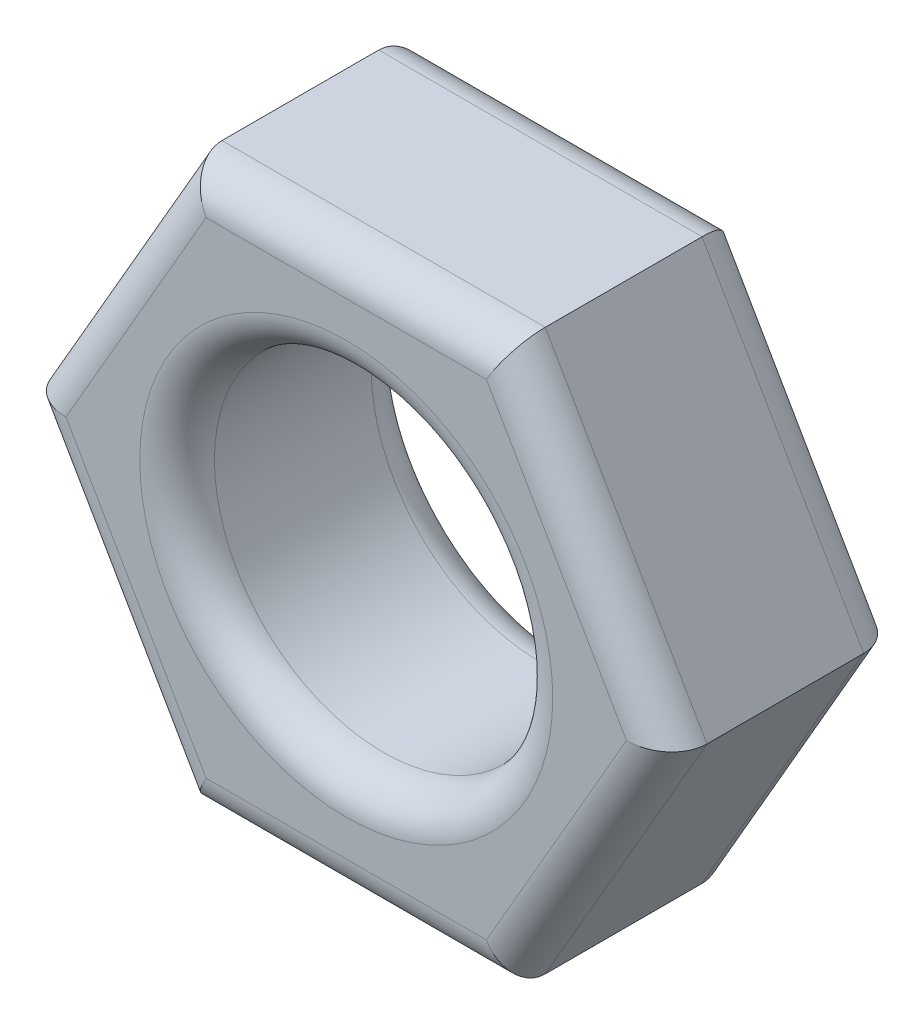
ISO-10303-21;
HEADER;
FILE_DESCRIPTION(('STEP AP214'),'2;1');
FILE_NAME('part.step','',(''),(''),'','','');
FILE_SCHEMA(('AUTOMOTIVE_DESIGN { 1 0 10303 214 1 1 1 1 }'));
ENDSEC;
DATA;
#1=APPLICATION_CONTEXT('core data for automotive mechanical design processes');
#2=APPLICATION_PROTOCOL_DEFINITION('international standard','automotive_design',2000,#1);
#3=PRODUCT_CONTEXT('',#1,'mechanical');
#4=PRODUCT('Part','Part','',(#3));
#5=PRODUCT_RELATED_PRODUCT_CATEGORY('part','',(#4));
#6=PRODUCT_DEFINITION_FORMATION('','',#4);
#7=PRODUCT_DEFINITION_CONTEXT('part definition',#1,'design');
#8=PRODUCT_DEFINITION('design','',#6,#7);
#9=PRODUCT_DEFINITION_SHAPE('','',#8);
#10=(LENGTH_UNIT() NAMED_UNIT(*) SI_UNIT(.MILLI.,.METRE.));
#11=(NAMED_UNIT(*) PLANE_ANGLE_UNIT() SI_UNIT($,.RADIAN.));
#12=(NAMED_UNIT(*) SI_UNIT($,.STERADIAN.) SOLID_ANGLE_UNIT());
#13=UNCERTAINTY_MEASURE_WITH_UNIT(LENGTH_MEASURE(1.E-05),#10,'distance_accuracy_value','');
#14=(GEOMETRIC_REPRESENTATION_CONTEXT(3) GLOBAL_UNCERTAINTY_ASSIGNED_CONTEXT((#13)) GLOBAL_UNIT_ASSIGNED_CONTEXT((#10,
#11,#12)) REPRESENTATION_CONTEXT('',''));
#15=CARTESIAN_POINT('',(0.,0.,0.));
#16=DIRECTION('',(0.,0.,1.));
#17=DIRECTION('',(1.,0.,0.));
#18=AXIS2_PLACEMENT_3D('',#15,#16,#17);
#19=CARTESIAN_POINT('',(16.4977839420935,9.52499999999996,7.874));
#20=DIRECTION('',(0.,0.,-1.));
#21=DIRECTION('',(-1.,0.,0.));
#22=AXIS2_PLACEMENT_3D('',#19,#20,#21);
#23=PLANE('',#22);
#24=CARTESIAN_POINT('',(0.,0.,7.874));
#25=DIRECTION('',(0.,0.,-1.));
#26=DIRECTION('',(-1.,0.,0.));
#27=AXIS2_PLACEMENT_3D('',#24,#25,#26);
#28=CIRCLE('',#27,7.0231);
#29=CARTESIAN_POINT('',(-7.0231,0.,7.874));
#30=VERTEX_POINT('',#29);
#31=EDGE_CURVE('E187',#30,#30,#28,.T.);
#32=ORIENTED_EDGE('',*,*,#31,.T.);
#33=EDGE_LOOP('',(#32));
#34=FACE_BOUND('',#33,.T.);
#35=DIRECTION('',(0.499999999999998,-0.86602540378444,0.));
#36=VECTOR('',#35,1.);
#37=CARTESIAN_POINT('',(-7.14903970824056,-4.12749999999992,7.874));
#38=LINE('',#37,#36);
#39=CARTESIAN_POINT('',(-9.53205294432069,0.,7.874));
#40=VERTEX_POINT('',#39);
#41=CARTESIAN_POINT('',(-4.76602647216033,-8.25500000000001,7.874));
#42=VERTEX_POINT('',#41);
#43=EDGE_CURVE('E182',#40,#42,#38,.T.);
#44=ORIENTED_EDGE('',*,*,#43,.T.);
#45=DIRECTION('',(1.,0.,0.));
#46=VECTOR('',#45,1.);
#47=CARTESIAN_POINT('',(16.4977839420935,-8.25500000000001,7.874));
#48=LINE('',#47,#46);
#49=CARTESIAN_POINT('',(4.76602647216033,-8.25500000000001,7.874));
#50=VERTEX_POINT('',#49);
#51=EDGE_CURVE('E184',#42,#50,#48,.T.);
#52=ORIENTED_EDGE('',*,*,#51,.T.);
#53=DIRECTION('',(0.499999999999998,0.86602540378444,0.));
#54=VECTOR('',#53,1.);
#55=CARTESIAN_POINT('',(15.3979316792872,10.16,7.874));
#56=LINE('',#55,#54);
#57=CARTESIAN_POINT('',(9.53205294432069,0.,7.874));
#58=VERTEX_POINT('',#57);
#59=EDGE_CURVE('E174',#50,#58,#56,.T.);
#60=ORIENTED_EDGE('',*,*,#59,.T.);
#61=DIRECTION('',(-0.499999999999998,0.86602540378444,0.));
#62=VECTOR('',#61,1.);
#63=CARTESIAN_POINT('',(7.14903970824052,4.12750000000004,7.874));
#64=LINE('',#63,#62);
#65=CARTESIAN_POINT('',(4.76602647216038,8.25499999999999,7.874));
#66=VERTEX_POINT('',#65);
#67=EDGE_CURVE('E176',#58,#66,#64,.T.);
#68=ORIENTED_EDGE('',*,*,#67,.T.);
#69=DIRECTION('',(-1.,0.,0.));
#70=VECTOR('',#69,1.);
#71=CARTESIAN_POINT('',(16.4977839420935,8.25499999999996,7.874));
#72=LINE('',#71,#70);
#73=CARTESIAN_POINT('',(-4.76602647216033,8.25500000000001,7.874));
#74=VERTEX_POINT('',#73);
#75=EDGE_CURVE('E178',#66,#74,#72,.T.);
#76=ORIENTED_EDGE('',*,*,#75,.T.);
#77=DIRECTION('',(-0.5,-0.866025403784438,0.));
#78=VECTOR('',#77,1.);
#79=CARTESIAN_POINT('',(1.09985226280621,18.4149999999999,7.874));
#80=LINE('',#79,#78);
#81=EDGE_CURVE('E180',#74,#40,#80,.T.);
#82=ORIENTED_EDGE('',*,*,#81,.T.);
#83=EDGE_LOOP('',(#44,#52,#60,#68,#76,#82));
#84=FACE_BOUND('',#83,.T.);
#85=ADVANCED_FACE('F28',(#34,#84),#23,.F.);
#86=CARTESIAN_POINT('',(16.4977839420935,9.52499999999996,0.));
#87=DIRECTION('',(0.,0.,-1.));
#88=DIRECTION('',(-1.,0.,0.));
#89=AXIS2_PLACEMENT_3D('',#86,#87,#88);
#90=PLANE('',#89);
#91=CARTESIAN_POINT('',(0.,0.,0.));
#92=DIRECTION('',(0.,0.,-1.));
#93=DIRECTION('',(-1.,0.,0.));
#94=AXIS2_PLACEMENT_3D('',#91,#92,#93);
#95=CIRCLE('',#94,7.0231);
#96=CARTESIAN_POINT('',(-7.0231,0.,0.));
#97=VERTEX_POINT('',#96);
#98=EDGE_CURVE('E144',#97,#97,#95,.F.);
#99=ORIENTED_EDGE('',*,*,#98,.T.);
#100=EDGE_LOOP('',(#99));
#101=FACE_BOUND('',#100,.T.);
#102=DIRECTION('',(-1.,0.,0.));
#103=VECTOR('',#102,1.);
#104=CARTESIAN_POINT('',(5.4992613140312,8.25499999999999,0.));
#105=LINE('',#104,#103);
#106=CARTESIAN_POINT('',(-4.76602647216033,8.25500000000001,0.));
#107=VERTEX_POINT('',#106);
#108=CARTESIAN_POINT('',(4.76602647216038,8.25499999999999,0.));
#109=VERTEX_POINT('',#108);
#110=EDGE_CURVE('E143',#107,#109,#105,.F.);
#111=ORIENTED_EDGE('',*,*,#110,.T.);
#112=DIRECTION('',(-0.499999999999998,0.86602540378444,0.));
#113=VECTOR('',#112,1.);
#114=CARTESIAN_POINT('',(9.8986703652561,-0.634999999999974,0.));
#115=LINE('',#114,#113);
#116=CARTESIAN_POINT('',(9.53205294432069,0.,0.));
#117=VERTEX_POINT('',#116);
#118=EDGE_CURVE('E122',#109,#117,#115,.F.);
#119=ORIENTED_EDGE('',*,*,#118,.T.);
#120=DIRECTION('',(0.499999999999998,0.86602540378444,0.));
#121=VECTOR('',#120,1.);
#122=CARTESIAN_POINT('',(9.8986703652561,0.635000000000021,0.));
#123=LINE('',#122,#121);
#124=CARTESIAN_POINT('',(4.76602647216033,-8.25500000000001,0.));
#125=VERTEX_POINT('',#124);
#126=EDGE_CURVE('E132',#117,#125,#123,.F.);
#127=ORIENTED_EDGE('',*,*,#126,.T.);
#128=DIRECTION('',(1.,0.,0.));
#129=VECTOR('',#128,1.);
#130=CARTESIAN_POINT('',(5.49926131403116,-8.25500000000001,0.));
#131=LINE('',#130,#129);
#132=CARTESIAN_POINT('',(-4.76602647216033,-8.25500000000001,0.));
#133=VERTEX_POINT('',#132);
#134=EDGE_CURVE('E138',#125,#133,#131,.F.);
#135=ORIENTED_EDGE('',*,*,#134,.T.);
#136=DIRECTION('',(0.499999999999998,-0.86602540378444,0.));
#137=VECTOR('',#136,1.);
#138=CARTESIAN_POINT('',(-9.8986703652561,0.635000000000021,0.));
#139=LINE('',#138,#137);
#140=CARTESIAN_POINT('',(-9.53205294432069,0.,0.));
#141=VERTEX_POINT('',#140);
#142=EDGE_CURVE('E245',#133,#141,#139,.F.);
#143=ORIENTED_EDGE('',*,*,#142,.T.);
#144=DIRECTION('',(-0.5,-0.866025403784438,0.));
#145=VECTOR('',#144,1.);
#146=CARTESIAN_POINT('',(-9.8986703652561,-0.634999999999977,0.));
#147=LINE('',#146,#145);
#148=EDGE_CURVE('E149',#141,#107,#147,.F.);
#149=ORIENTED_EDGE('',*,*,#148,.T.);
#150=EDGE_LOOP('',(#111,#119,#127,#135,#143,#149));
#151=FACE_BOUND('',#150,.T.);
#152=ADVANCED_FACE('F141',(#101,#151),#90,.T.);
#153=CARTESIAN_POINT('',(10.9985226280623,0.,7.874));
#154=DIRECTION('',(-0.86602540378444,0.499999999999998,0.));
#155=DIRECTION('',(-0.499999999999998,-0.86602540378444,0.));
#156=AXIS2_PLACEMENT_3D('',#153,#154,#155);
#157=PLANE('',#156);
#158=DIRECTION('',(0.,0.,-1.));
#159=VECTOR('',#158,1.);
#160=CARTESIAN_POINT('',(10.9985226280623,0.,7.874));
#161=LINE('',#160,#159);
#162=CARTESIAN_POINT('',(10.9985226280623,0.,6.604));
#163=VERTEX_POINT('',#162);
#164=CARTESIAN_POINT('',(10.9985226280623,0.,1.27));
#165=VERTEX_POINT('',#164);
#166=EDGE_CURVE('E139',#163,#165,#161,.T.);
#167=ORIENTED_EDGE('',*,*,#166,.F.);
#168=DIRECTION('',(0.499999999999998,0.86602540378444,0.));
#169=VECTOR('',#168,1.);
#170=CARTESIAN_POINT('',(10.9985226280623,0.,6.604));
#171=LINE('',#170,#169);
#172=CARTESIAN_POINT('',(5.49926131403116,-9.52500000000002,6.604));
#173=VERTEX_POINT('',#172);
#174=EDGE_CURVE('E11',#163,#173,#171,.F.);
#175=ORIENTED_EDGE('',*,*,#174,.T.);
#176=DIRECTION('',(0.,0.,-1.));
#177=VECTOR('',#176,1.);
#178=CARTESIAN_POINT('',(5.49926131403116,-9.52500000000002,7.874));
#179=LINE('',#178,#177);
#180=CARTESIAN_POINT('',(5.49926131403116,-9.52500000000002,1.27));
#181=VERTEX_POINT('',#180);
#182=EDGE_CURVE('E237',#173,#181,#179,.T.);
#183=ORIENTED_EDGE('',*,*,#182,.T.);
#184=DIRECTION('',(0.499999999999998,0.86602540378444,0.));
#185=VECTOR('',#184,1.);
#186=CARTESIAN_POINT('',(10.9985226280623,0.,1.27));
#187=LINE('',#186,#185);
#188=EDGE_CURVE('E168',#181,#165,#187,.T.);
#189=ORIENTED_EDGE('',*,*,#188,.T.);
#190=EDGE_LOOP('',(#167,#175,#183,#189));
#191=FACE_BOUND('',#190,.T.);
#192=ADVANCED_FACE('F30',(#191),#157,.F.);
#193=CARTESIAN_POINT('',(10.9985226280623,0.,7.874));
#194=DIRECTION('',(-0.86602540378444,-0.499999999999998,0.));
#195=DIRECTION('',(0.499999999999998,-0.86602540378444,0.));
#196=AXIS2_PLACEMENT_3D('',#193,#194,#195);
#197=PLANE('',#196);
#198=DIRECTION('',(0.,0.,-1.));
#199=VECTOR('',#198,1.);
#200=CARTESIAN_POINT('',(5.4992613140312,9.52499999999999,7.874));
#201=LINE('',#200,#199);
#202=CARTESIAN_POINT('',(5.4992613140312,9.52499999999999,6.604));
#203=VERTEX_POINT('',#202);
#204=CARTESIAN_POINT('',(5.4992613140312,9.52499999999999,1.27));
#205=VERTEX_POINT('',#204);
#206=EDGE_CURVE('E210',#203,#205,#201,.T.);
#207=ORIENTED_EDGE('',*,*,#206,.F.);
#208=DIRECTION('',(-0.499999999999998,0.86602540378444,0.));
#209=VECTOR('',#208,1.);
#210=CARTESIAN_POINT('',(10.9985226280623,0.,6.604));
#211=LINE('',#210,#209);
#212=EDGE_CURVE('E36',#203,#163,#211,.F.);
#213=ORIENTED_EDGE('',*,*,#212,.T.);
#214=ORIENTED_EDGE('',*,*,#166,.T.);
#215=DIRECTION('',(-0.499999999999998,0.86602540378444,0.));
#216=VECTOR('',#215,1.);
#217=CARTESIAN_POINT('',(10.9985226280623,0.,1.27));
#218=LINE('',#217,#216);
#219=EDGE_CURVE('E125',#165,#205,#218,.T.);
#220=ORIENTED_EDGE('',*,*,#219,.T.);
#221=EDGE_LOOP('',(#207,#213,#214,#220));
#222=FACE_BOUND('',#221,.T.);
#223=ADVANCED_FACE('F254',(#222),#197,.F.);
#224=CARTESIAN_POINT('',(5.4992613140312,9.52499999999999,7.874));
#225=DIRECTION('',(0.,-1.,0.));
#226=DIRECTION('',(1.,0.,0.));
#227=AXIS2_PLACEMENT_3D('',#224,#225,#226);
#228=PLANE('',#227);
#229=DIRECTION('',(0.,0.,-1.));
#230=VECTOR('',#229,1.);
#231=CARTESIAN_POINT('',(-5.49926131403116,9.52500000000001,7.874));
#232=LINE('',#231,#230);
#233=CARTESIAN_POINT('',(-5.49926131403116,9.52500000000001,6.604));
#234=VERTEX_POINT('',#233);
#235=CARTESIAN_POINT('',(-5.49926131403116,9.52500000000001,1.27));
#236=VERTEX_POINT('',#235);
#237=EDGE_CURVE('E201',#234,#236,#232,.T.);
#238=ORIENTED_EDGE('',*,*,#237,.F.);
#239=DIRECTION('',(-1.,0.,0.));
#240=VECTOR('',#239,1.);
#241=CARTESIAN_POINT('',(5.4992613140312,9.52499999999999,6.604));
#242=LINE('',#241,#240);
#243=EDGE_CURVE('E50',#234,#203,#242,.F.);
#244=ORIENTED_EDGE('',*,*,#243,.T.);
#245=ORIENTED_EDGE('',*,*,#206,.T.);
#246=DIRECTION('',(-1.,0.,0.));
#247=VECTOR('',#246,1.);
#248=CARTESIAN_POINT('',(5.4992613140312,9.52499999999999,1.27));
#249=LINE('',#248,#247);
#250=EDGE_CURVE('E156',#205,#236,#249,.T.);
#251=ORIENTED_EDGE('',*,*,#250,.T.);
#252=EDGE_LOOP('',(#238,#244,#245,#251));
#253=FACE_BOUND('',#252,.T.);
#254=ADVANCED_FACE('F207',(#253),#228,.F.);
#255=CARTESIAN_POINT('',(-10.9985226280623,0.,7.874));
#256=DIRECTION('',(0.866025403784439,-0.5,0.));
#257=DIRECTION('',(0.5,0.866025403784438,0.));
#258=AXIS2_PLACEMENT_3D('',#255,#256,#257);
#259=PLANE('',#258);
#260=DIRECTION('',(0.,0.,-1.));
#261=VECTOR('',#260,1.);
#262=CARTESIAN_POINT('',(-10.9985226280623,0.,7.874));
#263=LINE('',#262,#261);
#264=CARTESIAN_POINT('',(-10.9985226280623,0.,6.604));
#265=VERTEX_POINT('',#264);
#266=CARTESIAN_POINT('',(-10.9985226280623,0.,1.27));
#267=VERTEX_POINT('',#266);
#268=EDGE_CURVE('E202',#265,#267,#263,.T.);
#269=ORIENTED_EDGE('',*,*,#268,.F.);
#270=DIRECTION('',(-0.5,-0.866025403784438,0.));
#271=VECTOR('',#270,1.);
#272=CARTESIAN_POINT('',(-10.9985226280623,0.,6.604));
#273=LINE('',#272,#271);
#274=EDGE_CURVE('E195',#265,#234,#273,.F.);
#275=ORIENTED_EDGE('',*,*,#274,.T.);
#276=ORIENTED_EDGE('',*,*,#237,.T.);
#277=DIRECTION('',(-0.5,-0.866025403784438,0.));
#278=VECTOR('',#277,1.);
#279=CARTESIAN_POINT('',(-10.9985226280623,0.,1.27));
#280=LINE('',#279,#278);
#281=EDGE_CURVE('E159',#236,#267,#280,.T.);
#282=ORIENTED_EDGE('',*,*,#281,.T.);
#283=EDGE_LOOP('',(#269,#275,#276,#282));
#284=FACE_BOUND('',#283,.T.);
#285=ADVANCED_FACE('F200',(#284),#259,.F.);
#286=CARTESIAN_POINT('',(-10.9985226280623,0.,7.874));
#287=DIRECTION('',(0.86602540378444,0.499999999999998,0.));
#288=DIRECTION('',(-0.499999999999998,0.86602540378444,0.));
#289=AXIS2_PLACEMENT_3D('',#286,#287,#288);
#290=PLANE('',#289);
#291=DIRECTION('',(0.,0.,-1.));
#292=VECTOR('',#291,1.);
#293=CARTESIAN_POINT('',(-5.49926131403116,-9.52500000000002,7.874));
#294=LINE('',#293,#292);
#295=CARTESIAN_POINT('',(-5.49926131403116,-9.52500000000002,6.604));
#296=VERTEX_POINT('',#295);
#297=CARTESIAN_POINT('',(-5.49926131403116,-9.52500000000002,1.27));
#298=VERTEX_POINT('',#297);
#299=EDGE_CURVE('E239',#296,#298,#294,.T.);
#300=ORIENTED_EDGE('',*,*,#299,.F.);
#301=DIRECTION('',(0.499999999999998,-0.86602540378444,0.));
#302=VECTOR('',#301,1.);
#303=CARTESIAN_POINT('',(-10.9985226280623,0.,6.604));
#304=LINE('',#303,#302);
#305=EDGE_CURVE('E193',#296,#265,#304,.F.);
#306=ORIENTED_EDGE('',*,*,#305,.T.);
#307=ORIENTED_EDGE('',*,*,#268,.T.);
#308=DIRECTION('',(0.499999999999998,-0.86602540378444,0.));
#309=VECTOR('',#308,1.);
#310=CARTESIAN_POINT('',(-10.9985226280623,0.,1.27));
#311=LINE('',#310,#309);
#312=EDGE_CURVE('E162',#267,#298,#311,.T.);
#313=ORIENTED_EDGE('',*,*,#312,.T.);
#314=EDGE_LOOP('',(#300,#306,#307,#313));
#315=FACE_BOUND('',#314,.T.);
#316=ADVANCED_FACE('F271',(#315),#290,.F.);
#317=CARTESIAN_POINT('',(5.49926131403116,-9.52500000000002,7.874));
#318=DIRECTION('',(0.,1.,0.));
#319=DIRECTION('',(0.,0.,1.));
#320=AXIS2_PLACEMENT_3D('',#317,#318,#319);
#321=PLANE('',#320);
#322=ORIENTED_EDGE('',*,*,#182,.F.);
#323=DIRECTION('',(1.,0.,0.));
#324=VECTOR('',#323,1.);
#325=CARTESIAN_POINT('',(5.49926131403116,-9.52500000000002,6.604));
#326=LINE('',#325,#324);
#327=EDGE_CURVE('E190',#173,#296,#326,.F.);
#328=ORIENTED_EDGE('',*,*,#327,.T.);
#329=ORIENTED_EDGE('',*,*,#299,.T.);
#330=DIRECTION('',(1.,0.,0.));
#331=VECTOR('',#330,1.);
#332=CARTESIAN_POINT('',(5.49926131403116,-9.52500000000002,1.27));
#333=LINE('',#332,#331);
#334=EDGE_CURVE('E165',#298,#181,#333,.T.);
#335=ORIENTED_EDGE('',*,*,#334,.T.);
#336=EDGE_LOOP('',(#322,#328,#329,#335));
#337=FACE_BOUND('',#336,.T.);
#338=ADVANCED_FACE('F262',(#337),#321,.F.);
#339=CARTESIAN_POINT('',(0.,0.,7.874));
#340=DIRECTION('',(0.,0.,-1.));
#341=DIRECTION('',(-1.,0.,0.));
#342=AXIS2_PLACEMENT_3D('',#339,#340,#341);
#343=CYLINDRICAL_SURFACE('',#342,5.7531);
#344=CARTESIAN_POINT('',(0.,0.,6.604));
#345=DIRECTION('',(0.,0.,-1.));
#346=DIRECTION('',(-1.,0.,0.));
#347=AXIS2_PLACEMENT_3D('',#344,#345,#346);
#348=CIRCLE('',#347,5.7531);
#349=CARTESIAN_POINT('',(-5.7531,0.,6.604));
#350=VERTEX_POINT('',#349);
#351=EDGE_CURVE('E171',#350,#350,#348,.F.);
#352=ORIENTED_EDGE('',*,*,#351,.T.);
#353=EDGE_LOOP('',(#352));
#354=FACE_BOUND('',#353,.T.);
#355=CARTESIAN_POINT('',(0.,0.,1.27));
#356=DIRECTION('',(0.,0.,-1.));
#357=DIRECTION('',(-1.,0.,0.));
#358=AXIS2_PLACEMENT_3D('',#355,#356,#357);
#359=CIRCLE('',#358,5.7531);
#360=CARTESIAN_POINT('',(-5.7531,0.,1.27));
#361=VERTEX_POINT('',#360);
#362=EDGE_CURVE('E147',#361,#361,#359,.T.);
#363=ORIENTED_EDGE('',*,*,#362,.T.);
#364=EDGE_LOOP('',(#363));
#365=FACE_BOUND('',#364,.T.);
#366=ADVANCED_FACE('F307',(#354,#365),#343,.F.);
#367=CARTESIAN_POINT('',(0.,0.,1.27));
#368=DIRECTION('',(0.,0.,-1.));
#369=DIRECTION('',(-1.,0.,0.));
#370=AXIS2_PLACEMENT_3D('',#367,#368,#369);
#371=TOROIDAL_SURFACE('',#370,7.0231,1.27);
#372=ORIENTED_EDGE('',*,*,#362,.F.);
#373=EDGE_LOOP('',(#372));
#374=FACE_BOUND('',#373,.T.);
#375=ORIENTED_EDGE('',*,*,#98,.F.);
#376=EDGE_LOOP('',(#375));
#377=FACE_BOUND('',#376,.T.);
#378=ADVANCED_FACE('F363',(#374,#377),#371,.T.);
#379=CARTESIAN_POINT('',(-9.8986703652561,0.635000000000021,1.27));
#380=DIRECTION('',(-0.499999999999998,0.86602540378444,0.));
#381=DIRECTION('',(-0.86602540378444,-0.499999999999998,0.));
#382=AXIS2_PLACEMENT_3D('',#379,#380,#381);
#383=CYLINDRICAL_SURFACE('',#382,1.27);
#384=CARTESIAN_POINT('',(-9.53205294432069,0.,1.27));
#385=DIRECTION('',(0.,1.,0.));
#386=DIRECTION('',(-1.,0.,0.));
#387=AXIS2_PLACEMENT_3D('',#384,#385,#386);
#388=ELLIPSE('',#387,1.46646968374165,1.27);
#389=EDGE_CURVE('E231',#141,#267,#388,.T.);
#390=ORIENTED_EDGE('',*,*,#389,.F.);
#391=ORIENTED_EDGE('',*,*,#142,.F.);
#392=CARTESIAN_POINT('',(-4.76602647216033,-8.25500000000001,1.27));
#393=DIRECTION('',(-0.866025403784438,0.500000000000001,0.));
#394=DIRECTION('',(-0.500000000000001,-0.866025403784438,0.));
#395=AXIS2_PLACEMENT_3D('',#392,#393,#394);
#396=ELLIPSE('',#395,1.46646968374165,1.27);
#397=EDGE_CURVE('E234',#298,#133,#396,.F.);
#398=ORIENTED_EDGE('',*,*,#397,.F.);
#399=ORIENTED_EDGE('',*,*,#312,.F.);
#400=EDGE_LOOP('',(#390,#391,#398,#399));
#401=FACE_BOUND('',#400,.T.);
#402=ADVANCED_FACE('F268',(#401),#383,.T.);
#403=CARTESIAN_POINT('',(5.49926131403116,-8.25500000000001,1.27));
#404=DIRECTION('',(-1.,0.,0.));
#405=DIRECTION('',(0.,0.,1.));
#406=AXIS2_PLACEMENT_3D('',#403,#404,#405);
#407=CYLINDRICAL_SURFACE('',#406,1.27);
#408=ORIENTED_EDGE('',*,*,#397,.T.);
#409=ORIENTED_EDGE('',*,*,#134,.F.);
#410=CARTESIAN_POINT('',(4.76602647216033,-8.25500000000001,1.27));
#411=DIRECTION('',(-0.866025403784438,-0.500000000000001,0.));
#412=DIRECTION('',(0.500000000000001,-0.866025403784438,0.));
#413=AXIS2_PLACEMENT_3D('',#410,#411,#412);
#414=ELLIPSE('',#413,1.46646968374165,1.27);
#415=EDGE_CURVE('E135',#181,#125,#414,.F.);
#416=ORIENTED_EDGE('',*,*,#415,.F.);
#417=ORIENTED_EDGE('',*,*,#334,.F.);
#418=EDGE_LOOP('',(#408,#409,#416,#417));
#419=FACE_BOUND('',#418,.T.);
#420=ADVANCED_FACE('F265',(#419),#407,.T.);
#421=CARTESIAN_POINT('',(-9.8986703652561,-0.634999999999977,1.27));
#422=DIRECTION('',(0.5,0.866025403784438,0.));
#423=DIRECTION('',(-0.866025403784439,0.5,0.));
#424=AXIS2_PLACEMENT_3D('',#421,#422,#423);
#425=CYLINDRICAL_SURFACE('',#424,1.27);
#426=ORIENTED_EDGE('',*,*,#389,.T.);
#427=ORIENTED_EDGE('',*,*,#281,.F.);
#428=CARTESIAN_POINT('',(-4.76602647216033,8.25500000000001,1.27));
#429=DIRECTION('',(0.866025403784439,0.499999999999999,0.));
#430=DIRECTION('',(-0.499999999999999,0.866025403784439,0.));
#431=AXIS2_PLACEMENT_3D('',#428,#429,#430);
#432=ELLIPSE('',#431,1.46646968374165,1.27);
#433=EDGE_CURVE('E128',#107,#236,#432,.T.);
#434=ORIENTED_EDGE('',*,*,#433,.F.);
#435=ORIENTED_EDGE('',*,*,#148,.F.);
#436=EDGE_LOOP('',(#426,#427,#434,#435));
#437=FACE_BOUND('',#436,.T.);
#438=ADVANCED_FACE('F251',(#437),#425,.T.);
#439=CARTESIAN_POINT('',(9.8986703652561,0.635000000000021,1.27));
#440=DIRECTION('',(-0.499999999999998,-0.86602540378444,0.));
#441=DIRECTION('',(0.86602540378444,-0.499999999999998,0.));
#442=AXIS2_PLACEMENT_3D('',#439,#440,#441);
#443=CYLINDRICAL_SURFACE('',#442,1.27);
#444=ORIENTED_EDGE('',*,*,#415,.T.);
#445=ORIENTED_EDGE('',*,*,#126,.F.);
#446=CARTESIAN_POINT('',(9.53205294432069,0.,1.27));
#447=DIRECTION('',(0.,-1.,0.));
#448=DIRECTION('',(-1.,0.,0.));
#449=AXIS2_PLACEMENT_3D('',#446,#447,#448);
#450=ELLIPSE('',#449,1.46646968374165,1.27);
#451=EDGE_CURVE('E117',#165,#117,#450,.F.);
#452=ORIENTED_EDGE('',*,*,#451,.F.);
#453=ORIENTED_EDGE('',*,*,#188,.F.);
#454=EDGE_LOOP('',(#444,#445,#452,#453));
#455=FACE_BOUND('',#454,.T.);
#456=ADVANCED_FACE('F133',(#455),#443,.T.);
#457=CARTESIAN_POINT('',(5.4992613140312,8.25499999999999,1.27));
#458=DIRECTION('',(1.,0.,0.));
#459=DIRECTION('',(0.,1.,0.));
#460=AXIS2_PLACEMENT_3D('',#457,#458,#459);
#461=CYLINDRICAL_SURFACE('',#460,1.27);
#462=ORIENTED_EDGE('',*,*,#433,.T.);
#463=ORIENTED_EDGE('',*,*,#250,.F.);
#464=CARTESIAN_POINT('',(4.76602647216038,8.25499999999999,1.27));
#465=DIRECTION('',(0.866025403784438,-0.500000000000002,0.));
#466=DIRECTION('',(0.500000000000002,0.866025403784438,0.));
#467=AXIS2_PLACEMENT_3D('',#464,#465,#466);
#468=ELLIPSE('',#467,1.46646968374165,1.27);
#469=EDGE_CURVE('E129',#109,#205,#468,.T.);
#470=ORIENTED_EDGE('',*,*,#469,.F.);
#471=ORIENTED_EDGE('',*,*,#110,.F.);
#472=EDGE_LOOP('',(#462,#463,#470,#471));
#473=FACE_BOUND('',#472,.T.);
#474=ADVANCED_FACE('F253',(#473),#461,.T.);
#475=CARTESIAN_POINT('',(9.8986703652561,-0.634999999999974,1.27));
#476=DIRECTION('',(0.499999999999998,-0.86602540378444,0.));
#477=DIRECTION('',(0.86602540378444,0.499999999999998,0.));
#478=AXIS2_PLACEMENT_3D('',#475,#476,#477);
#479=CYLINDRICAL_SURFACE('',#478,1.27);
#480=ORIENTED_EDGE('',*,*,#451,.T.);
#481=ORIENTED_EDGE('',*,*,#118,.F.);
#482=ORIENTED_EDGE('',*,*,#469,.T.);
#483=ORIENTED_EDGE('',*,*,#219,.F.);
#484=EDGE_LOOP('',(#480,#481,#482,#483));
#485=FACE_BOUND('',#484,.T.);
#486=ADVANCED_FACE('F119',(#485),#479,.T.);
#487=CARTESIAN_POINT('',(0.,0.,6.604));
#488=DIRECTION('',(0.,0.,-1.));
#489=DIRECTION('',(-1.,0.,0.));
#490=AXIS2_PLACEMENT_3D('',#487,#488,#489);
#491=TOROIDAL_SURFACE('',#490,7.0231,1.27);
#492=ORIENTED_EDGE('',*,*,#31,.F.);
#493=EDGE_LOOP('',(#492));
#494=FACE_BOUND('',#493,.T.);
#495=ORIENTED_EDGE('',*,*,#351,.F.);
#496=EDGE_LOOP('',(#495));
#497=FACE_BOUND('',#496,.T.);
#498=ADVANCED_FACE('F414',(#494,#497),#491,.T.);
#499=CARTESIAN_POINT('',(16.4977839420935,8.25499999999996,6.604));
#500=DIRECTION('',(-1.,0.,0.));
#501=DIRECTION('',(0.,-1.,0.));
#502=AXIS2_PLACEMENT_3D('',#499,#500,#501);
#503=CYLINDRICAL_SURFACE('',#502,1.27);
#504=CARTESIAN_POINT('',(4.76602647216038,8.25499999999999,6.604));
#505=DIRECTION('',(-0.866025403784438,0.500000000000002,0.));
#506=DIRECTION('',(0.500000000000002,0.866025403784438,0.));
#507=AXIS2_PLACEMENT_3D('',#504,#505,#506);
#508=ELLIPSE('',#507,1.46646968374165,1.27);
#509=EDGE_CURVE('E220',#203,#66,#508,.F.);
#510=ORIENTED_EDGE('',*,*,#509,.F.);
#511=ORIENTED_EDGE('',*,*,#243,.F.);
#512=CARTESIAN_POINT('',(-4.76602647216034,8.25500000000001,6.604));
#513=DIRECTION('',(-0.866025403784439,-0.499999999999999,0.));
#514=DIRECTION('',(-0.499999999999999,0.866025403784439,0.));
#515=AXIS2_PLACEMENT_3D('',#512,#513,#514);
#516=ELLIPSE('',#515,1.46646968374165,1.27);
#517=EDGE_CURVE('E217',#74,#234,#516,.T.);
#518=ORIENTED_EDGE('',*,*,#517,.F.);
#519=ORIENTED_EDGE('',*,*,#75,.F.);
#520=EDGE_LOOP('',(#510,#511,#518,#519));
#521=FACE_BOUND('',#520,.T.);
#522=ADVANCED_FACE('F215',(#521),#503,.T.);
#523=CARTESIAN_POINT('',(1.09985226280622,18.4149999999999,6.604));
#524=DIRECTION('',(-0.5,-0.866025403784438,0.));
#525=DIRECTION('',(0.866025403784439,-0.5,0.));
#526=AXIS2_PLACEMENT_3D('',#523,#524,#525);
#527=CYLINDRICAL_SURFACE('',#526,1.27);
#528=ORIENTED_EDGE('',*,*,#517,.T.);
#529=ORIENTED_EDGE('',*,*,#274,.F.);
#530=CARTESIAN_POINT('',(-9.53205294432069,0.,6.604));
#531=DIRECTION('',(0.,-1.,0.));
#532=DIRECTION('',(-1.,0.,0.));
#533=AXIS2_PLACEMENT_3D('',#530,#531,#532);
#534=ELLIPSE('',#533,1.46646968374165,1.27);
#535=EDGE_CURVE('E224',#40,#265,#534,.T.);
#536=ORIENTED_EDGE('',*,*,#535,.F.);
#537=ORIENTED_EDGE('',*,*,#81,.F.);
#538=EDGE_LOOP('',(#528,#529,#536,#537));
#539=FACE_BOUND('',#538,.T.);
#540=ADVANCED_FACE('F221',(#539),#527,.T.);
#541=CARTESIAN_POINT('',(7.14903970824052,4.12750000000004,6.604));
#542=DIRECTION('',(-0.499999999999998,0.86602540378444,0.));
#543=DIRECTION('',(-0.86602540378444,-0.499999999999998,0.));
#544=AXIS2_PLACEMENT_3D('',#541,#542,#543);
#545=CYLINDRICAL_SURFACE('',#544,1.27);
#546=ORIENTED_EDGE('',*,*,#509,.T.);
#547=ORIENTED_EDGE('',*,*,#67,.F.);
#548=CARTESIAN_POINT('',(9.53205294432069,0.,6.604));
#549=DIRECTION('',(0.,1.,0.));
#550=DIRECTION('',(1.,0.,0.));
#551=AXIS2_PLACEMENT_3D('',#548,#549,#550);
#552=ELLIPSE('',#551,1.46646968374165,1.27);
#553=EDGE_CURVE('E288',#163,#58,#552,.F.);
#554=ORIENTED_EDGE('',*,*,#553,.F.);
#555=ORIENTED_EDGE('',*,*,#212,.F.);
#556=EDGE_LOOP('',(#546,#547,#554,#555));
#557=FACE_BOUND('',#556,.T.);
#558=ADVANCED_FACE('F293',(#557),#545,.T.);
#559=CARTESIAN_POINT('',(-7.14903970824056,-4.12749999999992,6.604));
#560=DIRECTION('',(0.499999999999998,-0.86602540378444,0.));
#561=DIRECTION('',(0.86602540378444,0.499999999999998,0.));
#562=AXIS2_PLACEMENT_3D('',#559,#560,#561);
#563=CYLINDRICAL_SURFACE('',#562,1.27);
#564=ORIENTED_EDGE('',*,*,#535,.T.);
#565=ORIENTED_EDGE('',*,*,#305,.F.);
#566=CARTESIAN_POINT('',(-4.76602647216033,-8.25500000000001,6.604));
#567=DIRECTION('',(0.866025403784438,-0.500000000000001,0.));
#568=DIRECTION('',(-0.500000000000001,-0.866025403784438,0.));
#569=AXIS2_PLACEMENT_3D('',#566,#567,#568);
#570=ELLIPSE('',#569,1.46646968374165,1.27);
#571=EDGE_CURVE('E277',#42,#296,#570,.T.);
#572=ORIENTED_EDGE('',*,*,#571,.F.);
#573=ORIENTED_EDGE('',*,*,#43,.F.);
#574=EDGE_LOOP('',(#564,#565,#572,#573));
#575=FACE_BOUND('',#574,.T.);
#576=ADVANCED_FACE('F275',(#575),#563,.T.);
#577=CARTESIAN_POINT('',(15.3979316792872,10.16,6.604));
#578=DIRECTION('',(0.499999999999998,0.86602540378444,0.));
#579=DIRECTION('',(-0.86602540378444,0.499999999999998,0.));
#580=AXIS2_PLACEMENT_3D('',#577,#578,#579);
#581=CYLINDRICAL_SURFACE('',#580,1.27);
#582=ORIENTED_EDGE('',*,*,#553,.T.);
#583=ORIENTED_EDGE('',*,*,#59,.F.);
#584=CARTESIAN_POINT('',(4.76602647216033,-8.25500000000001,6.604));
#585=DIRECTION('',(0.866025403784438,0.500000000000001,0.));
#586=DIRECTION('',(-0.500000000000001,0.866025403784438,0.));
#587=AXIS2_PLACEMENT_3D('',#584,#585,#586);
#588=ELLIPSE('',#587,1.46646968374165,1.27);
#589=EDGE_CURVE('E282',#173,#50,#588,.F.);
#590=ORIENTED_EDGE('',*,*,#589,.F.);
#591=ORIENTED_EDGE('',*,*,#174,.F.);
#592=EDGE_LOOP('',(#582,#583,#590,#591));
#593=FACE_BOUND('',#592,.T.);
#594=ADVANCED_FACE('F286',(#593),#581,.T.);
#595=CARTESIAN_POINT('',(16.4977839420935,-8.25500000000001,6.604));
#596=DIRECTION('',(1.,0.,0.));
#597=DIRECTION('',(0.,0.,-1.));
#598=AXIS2_PLACEMENT_3D('',#595,#596,#597);
#599=CYLINDRICAL_SURFACE('',#598,1.27);
#600=ORIENTED_EDGE('',*,*,#571,.T.);
#601=ORIENTED_EDGE('',*,*,#327,.F.);
#602=ORIENTED_EDGE('',*,*,#589,.T.);
#603=ORIENTED_EDGE('',*,*,#51,.F.);
#604=EDGE_LOOP('',(#600,#601,#602,#603));
#605=FACE_BOUND('',#604,.T.);
#606=ADVANCED_FACE('F281',(#605),#599,.T.);
#607=CLOSED_SHELL('',(#85,#152,#192,#223,#254,#285,#316,#338,#366,#378,#402,#420,#438,#456,#474,
#486,#498,#522,#540,#558,#576,#594,#606));
#608=MANIFOLD_SOLID_BREP('B2',#607);
#609=ADVANCED_BREP_SHAPE_REPRESENTATION('',(#18,#608),#14);
#610=SHAPE_DEFINITION_REPRESENTATION(#9,#609);
ENDSEC;
END-ISO-10303-21;
